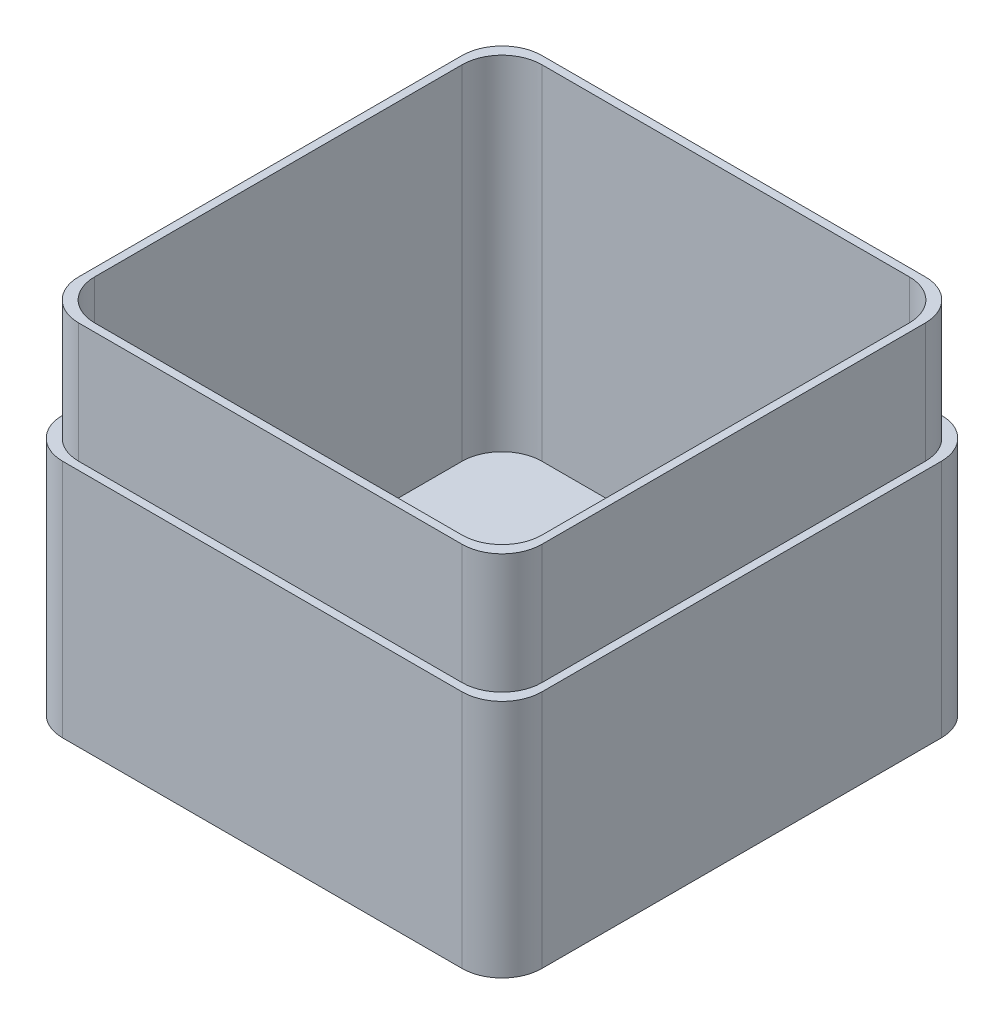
from build123d import *

# Parameters (mm, degrees)
CROQUIS2_W                   = 120
CROQUIS2_H                   = 120
SALIENTE_EXTRUIR1_DEPTH      = 90
VACIADO2_T                   = -4
CROQUIS3_W                   = 136
CROQUIS3_H                   = 136
CROQUIS3_W_2                 = 116
CROQUIS3_H_2                 = 116
CORTAR_EXTRUIR_L_MINA1_DEPTH = 30
REDONDEO3_R                  = 10


with BuildPart() as part:
    # Croquis2 → Saliente-Extruir1 (new body)
    with BuildSketch(Plane(origin=(0, 0, 0), x_dir=(1, 0, 0), z_dir=(0, 1, 0))):
        Rectangle(CROQUIS2_W, CROQUIS2_H)
    extrude(amount=SALIENTE_EXTRUIR1_DEPTH)

    # Vaciado2
    vaciado2_openings = [part.faces().sort_by_distance(p)[0] for p in [
        (0, 90, 0),
    ]]
    offset(amount=VACIADO2_T, openings=vaciado2_openings, kind=Kind.INTERSECTION)

    # Croquis3 → Cortar-Extruir-L_mina1 (cut)
    with BuildSketch(Plane(origin=(0, 90, 0), x_dir=(1, 0, 0), z_dir=(0, 1, 0))):
        Rectangle(CROQUIS3_W, CROQUIS3_H)
        Rectangle(CROQUIS3_W_2, CROQUIS3_H_2, mode=Mode.SUBTRACT)
    extrude(amount=-CORTAR_EXTRUIR_L_MINA1_DEPTH, mode=Mode.SUBTRACT)

    # Redondeo3
    redondeo3_edges = [part.edges().sort_by_distance(p)[0] for p in [
        (56, 47, 56),
        (56, 47, -56),
        (-56, 47, -56),
        (-56, 47, 56),
        (60, 30, 60),
        (-60, 30, 60),
        (-60, 30, -60),
        (60, 30, -60),
        (58, 75, 58),
        (-58, 75, 58),
        (-58, 75, -58),
        (58, 75, -58),
    ]]
    fillet(redondeo3_edges, radius=REDONDEO3_R)


solid = part.part
